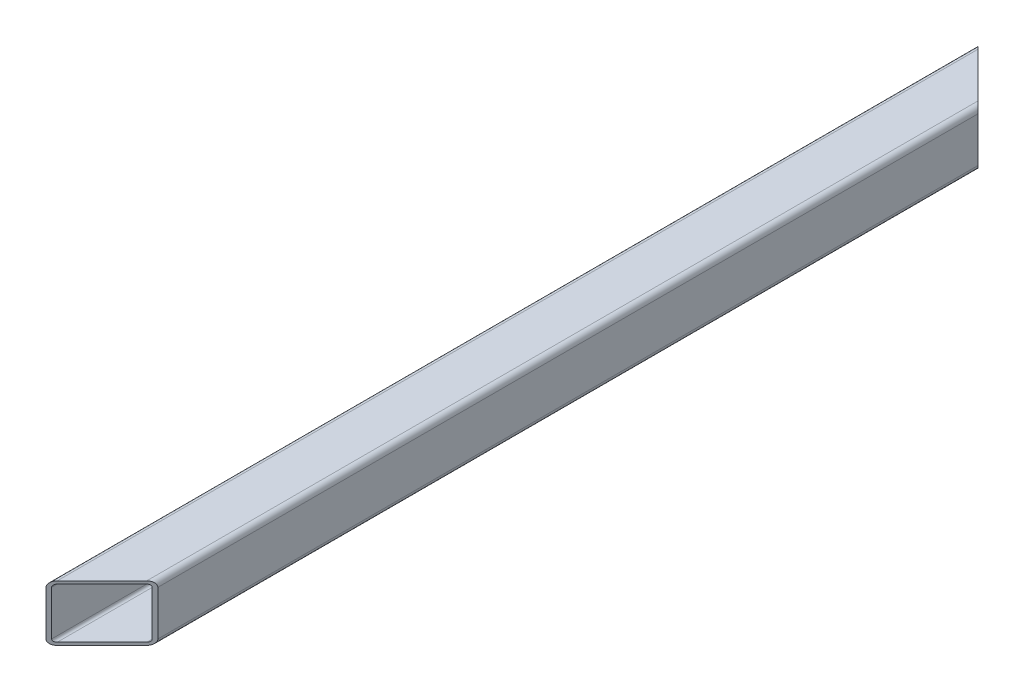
from build123d import *

# Parameters (mm, degrees)
AUFSATZ_LIN_GK_START         = -500
AUFSATZ_LIN_GK_DEPTH         = 1000
SCHNITT_LIN_GEHRUNG_VO_DEPTH = 508.148893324


with BuildPart() as part:
    # Profil → Aufsatz-Lin_GK (new body)
    with BuildSketch(Plane.XY.offset(AUFSATZ_LIN_GK_START)):
        with BuildLine():
            Line((6, -60), (54, -60))
            ThreePointArc((54, -60), (58.242640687, -58.242640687), (60, -54))
            Line((60, -54), (60, -6))
            ThreePointArc((60, -6), (58.242640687, -1.757359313), (54, 0))
            Line((54, 0), (6, 0))
            ThreePointArc((6, 0), (1.757359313, -1.757359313), (0, -6))
            Line((0, -6), (0, -54))
            ThreePointArc((0, -54), (1.757359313, -58.242640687), (6, -60))
        make_face()
        with BuildLine():
            Line((3, -54), (3, -6))
            ThreePointArc((3, -6), (3.878679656, -3.878679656), (6, -3))
            Line((6, -3), (54, -3))
            ThreePointArc((54, -3), (56.121320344, -3.878679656), (57, -6))
            Line((57, -6), (57, -54))
            ThreePointArc((57, -54), (56.121320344, -56.121320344), (54, -57))
            Line((54, -57), (6, -57))
            ThreePointArc((6, -57), (3.878679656, -56.121320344), (3, -54))
        make_face(mode=Mode.SUBTRACT)
    extrude(amount=AUFSATZ_LIN_GK_DEPTH)

    # Gehrung vo → Schnitt-Lin_Gehrung vo (cut, through all)
    with BuildSketch(Plane(origin=(0, 0, 0), x_dir=(1, 0, 0), z_dir=(0, 1, 0))):
        Polygon((-1423.827927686, -1923.827927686), (0, -500), (60, -440), (1483.827927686, 983.827927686), (4331.483783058, -1863.827927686), (1423.827927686, -4771.483783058), align=None)
    schnitt_lin_gehrung_vo = extrude(amount=-SCHNITT_LIN_GEHRUNG_VO_DEPTH, mode=Mode.SUBTRACT)

    # Spiegeln_Gehrung hi: Schnitt-Lin_Gehrung vo across plane
    add(schnitt_lin_gehrung_vo.mirror(Plane.XY), mode=Mode.SUBTRACT)


solid = part.part
